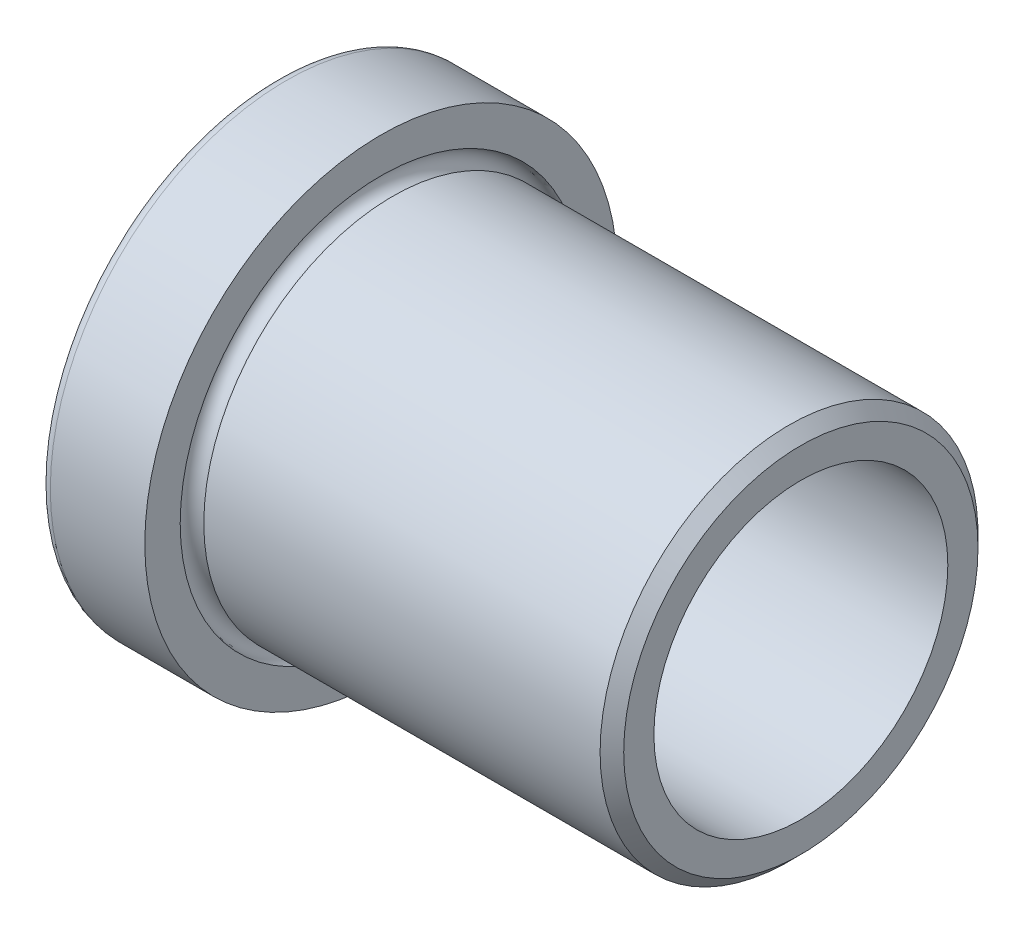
ISO-10303-21;
HEADER;
FILE_DESCRIPTION(('STEP AP214'),'2;1');
FILE_NAME('part.step','',(''),(''),'','','');
FILE_SCHEMA(('AUTOMOTIVE_DESIGN { 1 0 10303 214 1 1 1 1 }'));
ENDSEC;
DATA;
#1=APPLICATION_CONTEXT('core data for automotive mechanical design processes');
#2=APPLICATION_PROTOCOL_DEFINITION('international standard','automotive_design',2000,#1);
#3=PRODUCT_CONTEXT('',#1,'mechanical');
#4=PRODUCT('Part','Part','',(#3));
#5=PRODUCT_RELATED_PRODUCT_CATEGORY('part','',(#4));
#6=PRODUCT_DEFINITION_FORMATION('','',#4);
#7=PRODUCT_DEFINITION_CONTEXT('part definition',#1,'design');
#8=PRODUCT_DEFINITION('design','',#6,#7);
#9=PRODUCT_DEFINITION_SHAPE('','',#8);
#10=(LENGTH_UNIT() NAMED_UNIT(*) SI_UNIT(.MILLI.,.METRE.));
#11=(NAMED_UNIT(*) PLANE_ANGLE_UNIT() SI_UNIT($,.RADIAN.));
#12=(NAMED_UNIT(*) SI_UNIT($,.STERADIAN.) SOLID_ANGLE_UNIT());
#13=UNCERTAINTY_MEASURE_WITH_UNIT(LENGTH_MEASURE(1.E-05),#10,'distance_accuracy_value','');
#14=(GEOMETRIC_REPRESENTATION_CONTEXT(3) GLOBAL_UNCERTAINTY_ASSIGNED_CONTEXT((#13)) GLOBAL_UNIT_ASSIGNED_CONTEXT((#10,
#11,#12)) REPRESENTATION_CONTEXT('',''));
#15=CARTESIAN_POINT('',(0.,0.,0.));
#16=DIRECTION('',(0.,0.,1.));
#17=DIRECTION('',(1.,0.,0.));
#18=AXIS2_PLACEMENT_3D('',#15,#16,#17);
#19=CARTESIAN_POINT('',(15.875,35.7124,0.));
#20=DIRECTION('',(1.,0.,0.));
#21=DIRECTION('',(0.,0.,-1.));
#22=AXIS2_PLACEMENT_3D('',#19,#20,#21);
#23=PLANE('',#22);
#24=CARTESIAN_POINT('',(15.875,0.,0.));
#25=DIRECTION('',(-1.,0.,0.));
#26=DIRECTION('',(0.,0.,1.));
#27=AXIS2_PLACEMENT_3D('',#24,#25,#26);
#28=CIRCLE('',#27,30.35935);
#29=CARTESIAN_POINT('',(15.875,0.,30.35935));
#30=VERTEX_POINT('',#29);
#31=EDGE_CURVE('E83',#30,#30,#28,.T.);
#32=ORIENTED_EDGE('',*,*,#31,.T.);
#33=EDGE_LOOP('',(#32));
#34=FACE_BOUND('',#33,.T.);
#35=CARTESIAN_POINT('',(15.875,0.,0.));
#36=DIRECTION('',(-1.,0.,0.));
#37=DIRECTION('',(0.,0.,1.));
#38=AXIS2_PLACEMENT_3D('',#35,#36,#37);
#39=CIRCLE('',#38,35.7124);
#40=CARTESIAN_POINT('',(15.875,0.,35.7124));
#41=VERTEX_POINT('',#40);
#42=EDGE_CURVE('E10',#41,#41,#39,.T.);
#43=ORIENTED_EDGE('',*,*,#42,.F.);
#44=EDGE_LOOP('',(#43));
#45=FACE_BOUND('',#44,.T.);
#46=ADVANCED_FACE('F39',(#34,#45),#23,.T.);
#47=CARTESIAN_POINT('',(0.,0.,0.));
#48=DIRECTION('',(-1.,0.,0.));
#49=DIRECTION('',(0.,0.,1.));
#50=AXIS2_PLACEMENT_3D('',#47,#48,#49);
#51=CYLINDRICAL_SURFACE('',#50,35.7124);
#52=ORIENTED_EDGE('',*,*,#42,.T.);
#53=EDGE_LOOP('',(#52));
#54=FACE_BOUND('',#53,.T.);
#55=CARTESIAN_POINT('',(1.5875,0.,0.));
#56=DIRECTION('',(-1.,0.,0.));
#57=DIRECTION('',(0.,0.,1.));
#58=AXIS2_PLACEMENT_3D('',#55,#56,#57);
#59=CIRCLE('',#58,35.7124);
#60=CARTESIAN_POINT('',(1.5875,0.,35.7124));
#61=VERTEX_POINT('',#60);
#62=EDGE_CURVE('E46',#61,#61,#59,.T.);
#63=ORIENTED_EDGE('',*,*,#62,.F.);
#64=EDGE_LOOP('',(#63));
#65=FACE_BOUND('',#64,.T.);
#66=ADVANCED_FACE('F104',(#54,#65),#51,.T.);
#67=CARTESIAN_POINT('',(1.5875,0.,0.));
#68=DIRECTION('',(-1.,0.,0.));
#69=DIRECTION('',(0.,0.,1.));
#70=AXIS2_PLACEMENT_3D('',#67,#68,#69);
#71=TOROIDAL_SURFACE('',#70,34.1249,1.5875);
#72=CARTESIAN_POINT('',(0.,0.,0.));
#73=DIRECTION('',(-1.,0.,0.));
#74=DIRECTION('',(0.,0.,1.));
#75=AXIS2_PLACEMENT_3D('',#72,#73,#74);
#76=CIRCLE('',#75,34.1249);
#77=CARTESIAN_POINT('',(0.,0.,34.1249));
#78=VERTEX_POINT('',#77);
#79=EDGE_CURVE('E52',#78,#78,#76,.T.);
#80=ORIENTED_EDGE('',*,*,#79,.F.);
#81=EDGE_LOOP('',(#80));
#82=FACE_BOUND('',#81,.T.);
#83=ORIENTED_EDGE('',*,*,#62,.T.);
#84=EDGE_LOOP('',(#83));
#85=FACE_BOUND('',#84,.T.);
#86=ADVANCED_FACE('F108',(#82,#85),#71,.T.);
#87=CARTESIAN_POINT('',(0.,25.4,0.));
#88=DIRECTION('',(-1.,0.,0.));
#89=DIRECTION('',(0.,0.,1.));
#90=AXIS2_PLACEMENT_3D('',#87,#88,#89);
#91=PLANE('',#90);
#92=ORIENTED_EDGE('',*,*,#79,.T.);
#93=EDGE_LOOP('',(#92));
#94=FACE_BOUND('',#93,.T.);
#95=CARTESIAN_POINT('',(0.,0.,0.));
#96=DIRECTION('',(-1.,0.,0.));
#97=DIRECTION('',(0.,0.,1.));
#98=AXIS2_PLACEMENT_3D('',#95,#96,#97);
#99=CIRCLE('',#98,25.4);
#100=CARTESIAN_POINT('',(0.,0.,25.4));
#101=VERTEX_POINT('',#100);
#102=EDGE_CURVE('E56',#101,#101,#99,.T.);
#103=ORIENTED_EDGE('',*,*,#102,.F.);
#104=EDGE_LOOP('',(#103));
#105=FACE_BOUND('',#104,.T.);
#106=ADVANCED_FACE('F115',(#94,#105),#91,.T.);
#107=CARTESIAN_POINT('',(3.175,0.,0.));
#108=DIRECTION('',(-1.,0.,0.));
#109=DIRECTION('',(0.,0.,1.));
#110=AXIS2_PLACEMENT_3D('',#107,#108,#109);
#111=TOROIDAL_SURFACE('',#110,25.4,3.175);
#112=CARTESIAN_POINT('',(3.175,0.,0.));
#113=DIRECTION('',(-1.,0.,0.));
#114=DIRECTION('',(0.,0.,1.));
#115=AXIS2_PLACEMENT_3D('',#112,#113,#114);
#116=CIRCLE('',#115,22.225);
#117=CARTESIAN_POINT('',(3.175,0.,22.225));
#118=VERTEX_POINT('',#117);
#119=EDGE_CURVE('E63',#118,#118,#116,.T.);
#120=ORIENTED_EDGE('',*,*,#119,.F.);
#121=EDGE_LOOP('',(#120));
#122=FACE_BOUND('',#121,.T.);
#123=ORIENTED_EDGE('',*,*,#102,.T.);
#124=EDGE_LOOP('',(#123));
#125=FACE_BOUND('',#124,.T.);
#126=ADVANCED_FACE('F118',(#122,#125),#111,.T.);
#127=CARTESIAN_POINT('',(0.,0.,0.));
#128=DIRECTION('',(-1.,0.,0.));
#129=DIRECTION('',(0.,0.,1.));
#130=AXIS2_PLACEMENT_3D('',#127,#128,#129);
#131=CYLINDRICAL_SURFACE('',#130,22.225);
#132=ORIENTED_EDGE('',*,*,#119,.T.);
#133=EDGE_LOOP('',(#132));
#134=FACE_BOUND('',#133,.T.);
#135=CARTESIAN_POINT('',(79.375,0.,0.));
#136=DIRECTION('',(-1.,0.,0.));
#137=DIRECTION('',(0.,0.,1.));
#138=AXIS2_PLACEMENT_3D('',#135,#136,#137);
#139=CIRCLE('',#138,22.225);
#140=CARTESIAN_POINT('',(79.375,0.,22.225));
#141=VERTEX_POINT('',#140);
#142=EDGE_CURVE('E70',#141,#141,#139,.T.);
#143=ORIENTED_EDGE('',*,*,#142,.F.);
#144=EDGE_LOOP('',(#143));
#145=FACE_BOUND('',#144,.T.);
#146=ADVANCED_FACE('F124',(#134,#145),#131,.F.);
#147=CARTESIAN_POINT('',(79.375,26.7890625,0.));
#148=DIRECTION('',(1.,0.,0.));
#149=DIRECTION('',(0.,0.,-1.));
#150=AXIS2_PLACEMENT_3D('',#147,#148,#149);
#151=PLANE('',#150);
#152=ORIENTED_EDGE('',*,*,#142,.T.);
#153=EDGE_LOOP('',(#152));
#154=FACE_BOUND('',#153,.T.);
#155=CARTESIAN_POINT('',(79.375,0.,0.));
#156=DIRECTION('',(-1.,0.,0.));
#157=DIRECTION('',(0.,0.,1.));
#158=AXIS2_PLACEMENT_3D('',#155,#156,#157);
#159=CIRCLE('',#158,26.7890625);
#160=CARTESIAN_POINT('',(79.375,0.,26.7890625));
#161=VERTEX_POINT('',#160);
#162=EDGE_CURVE('E72',#161,#161,#159,.T.);
#163=ORIENTED_EDGE('',*,*,#162,.F.);
#164=EDGE_LOOP('',(#163));
#165=FACE_BOUND('',#164,.T.);
#166=ADVANCED_FACE('F130',(#154,#165),#151,.T.);
#167=CARTESIAN_POINT('',(77.5890625,0.,0.));
#168=DIRECTION('',(-1.,0.,0.));
#169=DIRECTION('',(0.,0.,1.));
#170=AXIS2_PLACEMENT_3D('',#167,#168,#169);
#171=CONICAL_SURFACE('',#170,28.575,0.785398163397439);
#172=ORIENTED_EDGE('',*,*,#162,.T.);
#173=EDGE_LOOP('',(#172));
#174=FACE_BOUND('',#173,.T.);
#175=CARTESIAN_POINT('',(77.5890625,0.,0.));
#176=DIRECTION('',(-1.,0.,0.));
#177=DIRECTION('',(0.,0.,1.));
#178=AXIS2_PLACEMENT_3D('',#175,#176,#177);
#179=CIRCLE('',#178,28.575);
#180=CARTESIAN_POINT('',(77.5890625,0.,28.575));
#181=VERTEX_POINT('',#180);
#182=EDGE_CURVE('E80',#181,#181,#179,.T.);
#183=ORIENTED_EDGE('',*,*,#182,.F.);
#184=EDGE_LOOP('',(#183));
#185=FACE_BOUND('',#184,.T.);
#186=ADVANCED_FACE('F99',(#174,#185),#171,.T.);
#187=CARTESIAN_POINT('',(0.,0.,0.));
#188=DIRECTION('',(-1.,0.,0.));
#189=DIRECTION('',(0.,0.,1.));
#190=AXIS2_PLACEMENT_3D('',#187,#188,#189);
#191=CYLINDRICAL_SURFACE('',#190,28.575);
#192=ORIENTED_EDGE('',*,*,#182,.T.);
#193=EDGE_LOOP('',(#192));
#194=FACE_BOUND('',#193,.T.);
#195=CARTESIAN_POINT('',(17.65935,0.,0.));
#196=DIRECTION('',(-1.,0.,0.));
#197=DIRECTION('',(0.,0.,1.));
#198=AXIS2_PLACEMENT_3D('',#195,#196,#197);
#199=CIRCLE('',#198,28.575);
#200=CARTESIAN_POINT('',(17.65935,0.,28.575));
#201=VERTEX_POINT('',#200);
#202=EDGE_CURVE('E82',#201,#201,#199,.T.);
#203=ORIENTED_EDGE('',*,*,#202,.F.);
#204=EDGE_LOOP('',(#203));
#205=FACE_BOUND('',#204,.T.);
#206=ADVANCED_FACE('F95',(#194,#205),#191,.T.);
#207=CARTESIAN_POINT('',(15.875,0.,0.));
#208=DIRECTION('',(-1.,0.,0.));
#209=DIRECTION('',(0.,0.,1.));
#210=AXIS2_PLACEMENT_3D('',#207,#208,#209);
#211=TOROIDAL_SURFACE('',#210,28.575,1.78435);
#212=ORIENTED_EDGE('',*,*,#202,.T.);
#213=EDGE_LOOP('',(#212));
#214=FACE_BOUND('',#213,.T.);
#215=ORIENTED_EDGE('',*,*,#31,.F.);
#216=EDGE_LOOP('',(#215));
#217=FACE_BOUND('',#216,.T.);
#218=ADVANCED_FACE('F94',(#214,#217),#211,.F.);
#219=CLOSED_SHELL('',(#46,#66,#86,#106,#126,#146,#166,#186,#206,#218));
#220=MANIFOLD_SOLID_BREP('B2',#219);
#221=ADVANCED_BREP_SHAPE_REPRESENTATION('',(#18,#220),#14);
#222=SHAPE_DEFINITION_REPRESENTATION(#9,#221);
ENDSEC;
END-ISO-10303-21;
